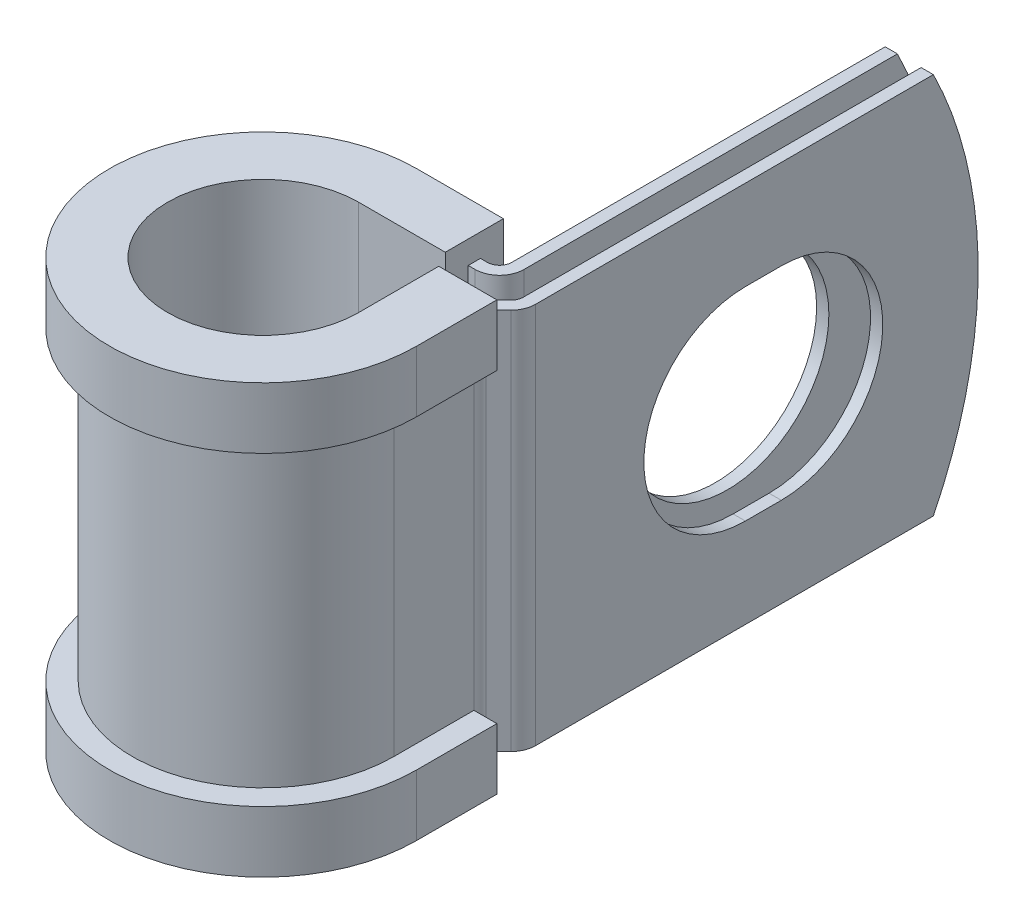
ISO-10303-21;
HEADER;
FILE_DESCRIPTION(('STEP AP214'),'2;1');
FILE_NAME('part.step','',(''),(''),'','','');
FILE_SCHEMA(('AUTOMOTIVE_DESIGN { 1 0 10303 214 1 1 1 1 }'));
ENDSEC;
DATA;
#1=APPLICATION_CONTEXT('core data for automotive mechanical design processes');
#2=APPLICATION_PROTOCOL_DEFINITION('international standard','automotive_design',2000,#1);
#3=PRODUCT_CONTEXT('',#1,'mechanical');
#4=PRODUCT('Part','Part','',(#3));
#5=PRODUCT_RELATED_PRODUCT_CATEGORY('part','',(#4));
#6=PRODUCT_DEFINITION_FORMATION('','',#4);
#7=PRODUCT_DEFINITION_CONTEXT('part definition',#1,'design');
#8=PRODUCT_DEFINITION('design','',#6,#7);
#9=PRODUCT_DEFINITION_SHAPE('','',#8);
#10=(LENGTH_UNIT() NAMED_UNIT(*) SI_UNIT(.MILLI.,.METRE.));
#11=(NAMED_UNIT(*) PLANE_ANGLE_UNIT() SI_UNIT($,.RADIAN.));
#12=(NAMED_UNIT(*) SI_UNIT($,.STERADIAN.) SOLID_ANGLE_UNIT());
#13=UNCERTAINTY_MEASURE_WITH_UNIT(LENGTH_MEASURE(1.E-05),#10,'distance_accuracy_value','');
#14=(GEOMETRIC_REPRESENTATION_CONTEXT(3) GLOBAL_UNCERTAINTY_ASSIGNED_CONTEXT((#13)) GLOBAL_UNIT_ASSIGNED_CONTEXT((#10,
#11,#12)) REPRESENTATION_CONTEXT('',''));
#15=CARTESIAN_POINT('',(0.,0.,0.));
#16=DIRECTION('',(0.,0.,1.));
#17=DIRECTION('',(1.,0.,0.));
#18=AXIS2_PLACEMENT_3D('',#15,#16,#17);
#19=CARTESIAN_POINT('',(8.60157438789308,-12.7,-7.874));
#20=DIRECTION('',(0.,1.,0.));
#21=DIRECTION('',(1.,0.,0.));
#22=AXIS2_PLACEMENT_3D('',#19,#20,#21);
#23=PLANE('',#22);
#24=DIRECTION('',(0.,0.,-1.));
#25=VECTOR('',#24,1.);
#26=CARTESIAN_POINT('',(5.75677438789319,-12.7,-7.87399999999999));
#27=LINE('',#26,#25);
#28=CARTESIAN_POINT('',(5.75677438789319,-12.7,-7.87399999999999));
#29=VERTEX_POINT('',#28);
#30=CARTESIAN_POINT('',(5.7567743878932,-12.7,-8.6868));
#31=VERTEX_POINT('',#30);
#32=EDGE_CURVE('E523',#29,#31,#27,.T.);
#33=ORIENTED_EDGE('',*,*,#32,.T.);
#34=DIRECTION('',(1.,0.,0.));
#35=VECTOR('',#34,1.);
#36=CARTESIAN_POINT('',(0.,-12.7,-8.6868));
#37=LINE('',#36,#35);
#38=CARTESIAN_POINT('',(6.21397438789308,-12.7,-8.6868));
#39=VERTEX_POINT('',#38);
#40=EDGE_CURVE('E410',#39,#31,#37,.F.);
#41=ORIENTED_EDGE('',*,*,#40,.F.);
#42=CARTESIAN_POINT('',(6.21397438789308,-12.7,-9.4996));
#43=DIRECTION('',(0.,1.,0.));
#44=DIRECTION('',(1.,0.,0.));
#45=AXIS2_PLACEMENT_3D('',#42,#43,#44);
#46=CIRCLE('',#45,0.812799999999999);
#47=CARTESIAN_POINT('',(7.02677438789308,-12.7,-9.4996));
#48=VERTEX_POINT('',#47);
#49=EDGE_CURVE('E408',#48,#39,#46,.F.);
#50=ORIENTED_EDGE('',*,*,#49,.F.);
#51=DIRECTION('',(0.,0.,1.));
#52=VECTOR('',#51,1.);
#53=CARTESIAN_POINT('',(7.02677438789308,-12.7,-37.2872));
#54=LINE('',#53,#52);
#55=CARTESIAN_POINT('',(7.02677438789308,-12.7,-34.3098683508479));
#56=VERTEX_POINT('',#55);
#57=EDGE_CURVE('E406',#56,#48,#54,.T.);
#58=ORIENTED_EDGE('',*,*,#57,.F.);
#59=DIRECTION('',(-1.,0.,0.));
#60=VECTOR('',#59,1.);
#61=CARTESIAN_POINT('',(10.2271743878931,-12.7,-34.3098683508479));
#62=LINE('',#61,#60);
#63=CARTESIAN_POINT('',(7.83957438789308,-12.7,-34.3098683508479));
#64=VERTEX_POINT('',#63);
#65=EDGE_CURVE('E12',#64,#56,#62,.T.);
#66=ORIENTED_EDGE('',*,*,#65,.F.);
#67=DIRECTION('',(0.,0.,1.));
#68=VECTOR('',#67,1.);
#69=CARTESIAN_POINT('',(7.83957438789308,-12.7,-37.2872));
#70=LINE('',#69,#68);
#71=CARTESIAN_POINT('',(7.83957438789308,-12.7,-9.4996));
#72=VERTEX_POINT('',#71);
#73=EDGE_CURVE('E404',#64,#72,#70,.T.);
#74=ORIENTED_EDGE('',*,*,#73,.T.);
#75=CARTESIAN_POINT('',(6.21397438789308,-12.7,-9.4996));
#76=DIRECTION('',(0.,-1.,0.));
#77=DIRECTION('',(0.,0.,1.));
#78=AXIS2_PLACEMENT_3D('',#75,#76,#77);
#79=CIRCLE('',#78,1.6256);
#80=CARTESIAN_POINT('',(6.21397438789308,-12.7,-7.874));
#81=VERTEX_POINT('',#80);
#82=EDGE_CURVE('E401',#72,#81,#79,.T.);
#83=ORIENTED_EDGE('',*,*,#82,.T.);
#84=DIRECTION('',(-1.,0.,0.));
#85=VECTOR('',#84,1.);
#86=CARTESIAN_POINT('',(0.,-12.7,-7.874));
#87=LINE('',#86,#85);
#88=EDGE_CURVE('E398',#81,#29,#87,.T.);
#89=ORIENTED_EDGE('',*,*,#88,.T.);
#90=EDGE_LOOP('',(#33,#41,#50,#58,#66,#74,#83,#89));
#91=FACE_BOUND('',#90,.T.);
#92=ADVANCED_FACE('F54',(#91),#23,.F.);
#93=CARTESIAN_POINT('',(8.60157438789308,12.7,-7.874));
#94=DIRECTION('',(0.,1.,0.));
#95=DIRECTION('',(1.,0.,0.));
#96=AXIS2_PLACEMENT_3D('',#93,#94,#95);
#97=PLANE('',#96);
#98=DIRECTION('',(1.,0.,0.));
#99=VECTOR('',#98,1.);
#100=CARTESIAN_POINT('',(0.,12.7,-8.6868));
#101=LINE('',#100,#99);
#102=CARTESIAN_POINT('',(6.21397438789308,12.7,-8.6868));
#103=VERTEX_POINT('',#102);
#104=CARTESIAN_POINT('',(5.7567743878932,12.7,-8.6868));
#105=VERTEX_POINT('',#104);
#106=EDGE_CURVE('E368',#103,#105,#101,.F.);
#107=ORIENTED_EDGE('',*,*,#106,.T.);
#108=DIRECTION('',(0.,0.,1.));
#109=VECTOR('',#108,1.);
#110=CARTESIAN_POINT('',(5.7567743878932,12.7,-8.6868));
#111=LINE('',#110,#109);
#112=CARTESIAN_POINT('',(5.75677438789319,12.7,-7.874));
#113=VERTEX_POINT('',#112);
#114=EDGE_CURVE('E517',#105,#113,#111,.T.);
#115=ORIENTED_EDGE('',*,*,#114,.T.);
#116=DIRECTION('',(-1.,0.,0.));
#117=VECTOR('',#116,1.);
#118=CARTESIAN_POINT('',(0.,12.7,-7.874));
#119=LINE('',#118,#117);
#120=CARTESIAN_POINT('',(6.21397438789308,12.7,-7.874));
#121=VERTEX_POINT('',#120);
#122=EDGE_CURVE('E625',#121,#113,#119,.T.);
#123=ORIENTED_EDGE('',*,*,#122,.F.);
#124=CARTESIAN_POINT('',(6.21397438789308,12.7,-9.4996));
#125=DIRECTION('',(0.,-1.,0.));
#126=DIRECTION('',(0.,0.,1.));
#127=AXIS2_PLACEMENT_3D('',#124,#125,#126);
#128=CIRCLE('',#127,1.6256);
#129=CARTESIAN_POINT('',(7.83957438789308,12.7,-9.4996));
#130=VERTEX_POINT('',#129);
#131=EDGE_CURVE('E370',#130,#121,#128,.T.);
#132=ORIENTED_EDGE('',*,*,#131,.F.);
#133=DIRECTION('',(0.,0.,1.));
#134=VECTOR('',#133,1.);
#135=CARTESIAN_POINT('',(7.83957438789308,12.7,-37.2872));
#136=LINE('',#135,#134);
#137=CARTESIAN_POINT('',(7.83957438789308,12.7,-34.3098683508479));
#138=VERTEX_POINT('',#137);
#139=EDGE_CURVE('E361',#138,#130,#136,.T.);
#140=ORIENTED_EDGE('',*,*,#139,.F.);
#141=DIRECTION('',(-1.,0.,0.));
#142=VECTOR('',#141,1.);
#143=CARTESIAN_POINT('',(10.2271743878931,12.7,-34.3098683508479));
#144=LINE('',#143,#142);
#145=CARTESIAN_POINT('',(7.02677438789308,12.7,-34.3098683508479));
#146=VERTEX_POINT('',#145);
#147=EDGE_CURVE('E62',#138,#146,#144,.T.);
#148=ORIENTED_EDGE('',*,*,#147,.T.);
#149=DIRECTION('',(0.,0.,1.));
#150=VECTOR('',#149,1.);
#151=CARTESIAN_POINT('',(7.02677438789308,12.7,-37.2872));
#152=LINE('',#151,#150);
#153=CARTESIAN_POINT('',(7.02677438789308,12.7,-9.4996));
#154=VERTEX_POINT('',#153);
#155=EDGE_CURVE('E358',#146,#154,#152,.T.);
#156=ORIENTED_EDGE('',*,*,#155,.T.);
#157=CARTESIAN_POINT('',(6.21397438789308,12.7,-9.4996));
#158=DIRECTION('',(0.,1.,0.));
#159=DIRECTION('',(1.,0.,0.));
#160=AXIS2_PLACEMENT_3D('',#157,#158,#159);
#161=CIRCLE('',#160,0.812799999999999);
#162=EDGE_CURVE('E366',#154,#103,#161,.F.);
#163=ORIENTED_EDGE('',*,*,#162,.T.);
#164=EDGE_LOOP('',(#107,#115,#123,#132,#140,#148,#156,#163));
#165=FACE_BOUND('',#164,.T.);
#166=ADVANCED_FACE('F357',(#165),#97,.T.);
#167=CARTESIAN_POINT('',(0.,12.7,-7.874));
#168=DIRECTION('',(0.,0.,1.));
#169=DIRECTION('',(1.,0.,0.));
#170=AXIS2_PLACEMENT_3D('',#167,#168,#169);
#171=PLANE('',#170);
#172=ORIENTED_EDGE('',*,*,#122,.T.);
#173=DIRECTION('',(0.,-1.,0.));
#174=VECTOR('',#173,1.);
#175=CARTESIAN_POINT('',(5.75677438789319,12.7,-7.874));
#176=LINE('',#175,#174);
#177=EDGE_CURVE('E520',#113,#29,#176,.T.);
#178=ORIENTED_EDGE('',*,*,#177,.T.);
#179=ORIENTED_EDGE('',*,*,#88,.F.);
#180=DIRECTION('',(0.,-1.,0.));
#181=VECTOR('',#180,1.);
#182=CARTESIAN_POINT('',(6.21397438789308,12.7,-7.874));
#183=LINE('',#182,#181);
#184=EDGE_CURVE('E344',#121,#81,#183,.T.);
#185=ORIENTED_EDGE('',*,*,#184,.F.);
#186=EDGE_LOOP('',(#172,#178,#179,#185));
#187=FACE_BOUND('',#186,.T.);
#188=ADVANCED_FACE('F635',(#187),#171,.T.);
#189=CARTESIAN_POINT('',(10.2271743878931,12.7,-7.874));
#190=DIRECTION('',(-1.,0.,0.));
#191=DIRECTION('',(0.,0.,1.));
#192=AXIS2_PLACEMENT_3D('',#189,#190,#191);
#193=PLANE('',#192);
#194=CARTESIAN_POINT('',(10.2271743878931,0.,-24.2061999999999));
#195=DIRECTION('',(1.,0.,0.));
#196=DIRECTION('',(0.,0.,-1.));
#197=AXIS2_PLACEMENT_3D('',#194,#195,#196);
#198=CIRCLE('',#197,6.7437);
#199=CARTESIAN_POINT('',(10.2271743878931,-6.7437,-24.2062000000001));
#200=VERTEX_POINT('',#199);
#201=CARTESIAN_POINT('',(10.2271743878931,6.7437,-24.2062000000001));
#202=VERTEX_POINT('',#201);
#203=EDGE_CURVE('E580',#200,#202,#198,.T.);
#204=ORIENTED_EDGE('',*,*,#203,.F.);
#205=DIRECTION('',(0.,0.,-1.));
#206=VECTOR('',#205,1.);
#207=CARTESIAN_POINT('',(10.2271743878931,-6.7437,-21.8185999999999));
#208=LINE('',#207,#206);
#209=CARTESIAN_POINT('',(10.2271743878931,-6.7437,-21.8185999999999));
#210=VERTEX_POINT('',#209);
#211=EDGE_CURVE('E583',#210,#200,#208,.T.);
#212=ORIENTED_EDGE('',*,*,#211,.F.);
#213=CARTESIAN_POINT('',(10.2271743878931,0.,-21.8185999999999));
#214=DIRECTION('',(1.,0.,0.));
#215=DIRECTION('',(0.,0.,-1.));
#216=AXIS2_PLACEMENT_3D('',#213,#214,#215);
#217=CIRCLE('',#216,6.7437);
#218=CARTESIAN_POINT('',(10.2271743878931,6.7437,-21.8185999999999));
#219=VERTEX_POINT('',#218);
#220=EDGE_CURVE('E576',#219,#210,#217,.T.);
#221=ORIENTED_EDGE('',*,*,#220,.F.);
#222=DIRECTION('',(0.,0.,1.));
#223=VECTOR('',#222,1.);
#224=CARTESIAN_POINT('',(10.2271743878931,6.7437,-21.8185999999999));
#225=LINE('',#224,#223);
#226=EDGE_CURVE('E577',#202,#219,#225,.T.);
#227=ORIENTED_EDGE('',*,*,#226,.F.);
#228=EDGE_LOOP('',(#204,#212,#221,#227));
#229=FACE_BOUND('',#228,.T.);
#230=DIRECTION('',(0.,0.,-1.));
#231=VECTOR('',#230,1.);
#232=CARTESIAN_POINT('',(10.2271743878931,-12.7,-7.874));
#233=LINE('',#232,#231);
#234=CARTESIAN_POINT('',(10.2271743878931,-12.7,-7.874));
#235=VERTEX_POINT('',#234);
#236=CARTESIAN_POINT('',(10.2271743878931,-12.7,-34.3098683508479));
#237=VERTEX_POINT('',#236);
#238=EDGE_CURVE('E382',#235,#237,#233,.T.);
#239=ORIENTED_EDGE('',*,*,#238,.T.);
#240=CARTESIAN_POINT('',(10.2271743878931,0.,-8.7122));
#241=DIRECTION('',(-1.,0.,0.));
#242=DIRECTION('',(0.,0.,1.));
#243=AXIS2_PLACEMENT_3D('',#240,#241,#242);
#244=CIRCLE('',#243,28.575);
#245=CARTESIAN_POINT('',(10.2271743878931,12.7,-34.3098683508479));
#246=VERTEX_POINT('',#245);
#247=EDGE_CURVE('E568',#246,#237,#244,.T.);
#248=ORIENTED_EDGE('',*,*,#247,.F.);
#249=DIRECTION('',(0.,0.,-1.));
#250=VECTOR('',#249,1.);
#251=CARTESIAN_POINT('',(10.2271743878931,12.7,-7.874));
#252=LINE('',#251,#250);
#253=CARTESIAN_POINT('',(10.2271743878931,12.7,-7.874));
#254=VERTEX_POINT('',#253);
#255=EDGE_CURVE('E419',#254,#246,#252,.T.);
#256=ORIENTED_EDGE('',*,*,#255,.F.);
#257=DIRECTION('',(0.,-1.,0.));
#258=VECTOR('',#257,1.);
#259=CARTESIAN_POINT('',(10.2271743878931,12.7,-7.874));
#260=LINE('',#259,#258);
#261=EDGE_CURVE('E381',#254,#235,#260,.T.);
#262=ORIENTED_EDGE('',*,*,#261,.T.);
#263=EDGE_LOOP('',(#239,#248,#256,#262));
#264=FACE_BOUND('',#263,.T.);
#265=ADVANCED_FACE('F56',(#229,#264),#193,.F.);
#266=CARTESIAN_POINT('',(9.41437438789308,12.7,-7.874));
#267=DIRECTION('',(-1.,0.,0.));
#268=DIRECTION('',(0.,0.,1.));
#269=AXIS2_PLACEMENT_3D('',#266,#267,#268);
#270=PLANE('',#269);
#271=DIRECTION('',(0.,0.,-1.));
#272=VECTOR('',#271,1.);
#273=CARTESIAN_POINT('',(9.41437438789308,-6.7437,-21.8185999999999));
#274=LINE('',#273,#272);
#275=CARTESIAN_POINT('',(9.41437438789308,-6.7437,-21.8185999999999));
#276=VERTEX_POINT('',#275);
#277=CARTESIAN_POINT('',(9.41437438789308,-6.7437,-24.2062000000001));
#278=VERTEX_POINT('',#277);
#279=EDGE_CURVE('E579',#276,#278,#274,.T.);
#280=ORIENTED_EDGE('',*,*,#279,.T.);
#281=CARTESIAN_POINT('',(9.41437438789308,0.,-24.2061999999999));
#282=DIRECTION('',(-1.,0.,0.));
#283=DIRECTION('',(0.,0.,1.));
#284=AXIS2_PLACEMENT_3D('',#281,#282,#283);
#285=CIRCLE('',#284,6.7437);
#286=CARTESIAN_POINT('',(9.41437438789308,6.7437,-24.2062000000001));
#287=VERTEX_POINT('',#286);
#288=EDGE_CURVE('E600',#278,#287,#285,.F.);
#289=ORIENTED_EDGE('',*,*,#288,.T.);
#290=DIRECTION('',(0.,0.,1.));
#291=VECTOR('',#290,1.);
#292=CARTESIAN_POINT('',(9.41437438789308,6.7437,-21.8185999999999));
#293=LINE('',#292,#291);
#294=CARTESIAN_POINT('',(9.41437438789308,6.7437,-21.8185999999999));
#295=VERTEX_POINT('',#294);
#296=EDGE_CURVE('E596',#287,#295,#293,.T.);
#297=ORIENTED_EDGE('',*,*,#296,.T.);
#298=CARTESIAN_POINT('',(9.41437438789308,0.,-21.8185999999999));
#299=DIRECTION('',(-1.,0.,0.));
#300=DIRECTION('',(0.,0.,1.));
#301=AXIS2_PLACEMENT_3D('',#298,#299,#300);
#302=CIRCLE('',#301,6.7437);
#303=EDGE_CURVE('E591',#295,#276,#302,.F.);
#304=ORIENTED_EDGE('',*,*,#303,.T.);
#305=EDGE_LOOP('',(#280,#289,#297,#304));
#306=FACE_BOUND('',#305,.T.);
#307=CARTESIAN_POINT('',(9.41437438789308,0.,-8.7122));
#308=DIRECTION('',(-1.,0.,0.));
#309=DIRECTION('',(0.,0.,1.));
#310=AXIS2_PLACEMENT_3D('',#307,#308,#309);
#311=CIRCLE('',#310,28.575);
#312=CARTESIAN_POINT('',(9.41437438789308,12.7,-34.3098683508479));
#313=VERTEX_POINT('',#312);
#314=CARTESIAN_POINT('',(9.41437438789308,-12.7,-34.3098683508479));
#315=VERTEX_POINT('',#314);
#316=EDGE_CURVE('E76',#313,#315,#311,.T.);
#317=ORIENTED_EDGE('',*,*,#316,.T.);
#318=DIRECTION('',(0.,0.,-1.));
#319=VECTOR('',#318,1.);
#320=CARTESIAN_POINT('',(9.41437438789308,-12.7,-7.874));
#321=LINE('',#320,#319);
#322=CARTESIAN_POINT('',(9.41437438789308,-12.7,-7.874));
#323=VERTEX_POINT('',#322);
#324=EDGE_CURVE('E385',#323,#315,#321,.T.);
#325=ORIENTED_EDGE('',*,*,#324,.F.);
#326=DIRECTION('',(0.,-1.,0.));
#327=VECTOR('',#326,1.);
#328=CARTESIAN_POINT('',(9.41437438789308,12.7,-7.874));
#329=LINE('',#328,#327);
#330=CARTESIAN_POINT('',(9.41437438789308,12.7,-7.874));
#331=VERTEX_POINT('',#330);
#332=EDGE_CURVE('E352',#331,#323,#329,.T.);
#333=ORIENTED_EDGE('',*,*,#332,.F.);
#334=DIRECTION('',(0.,0.,-1.));
#335=VECTOR('',#334,1.);
#336=CARTESIAN_POINT('',(9.41437438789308,12.7,-7.874));
#337=LINE('',#336,#335);
#338=EDGE_CURVE('E615',#331,#313,#337,.T.);
#339=ORIENTED_EDGE('',*,*,#338,.T.);
#340=EDGE_LOOP('',(#317,#325,#333,#339));
#341=FACE_BOUND('',#340,.T.);
#342=ADVANCED_FACE('F689',(#306,#341),#270,.T.);
#343=CARTESIAN_POINT('',(7.83957438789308,12.7,-37.2872));
#344=DIRECTION('',(1.,0.,0.));
#345=DIRECTION('',(0.,0.,-1.));
#346=AXIS2_PLACEMENT_3D('',#343,#344,#345);
#347=PLANE('',#346);
#348=CARTESIAN_POINT('',(7.83957438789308,0.,-23.0124));
#349=DIRECTION('',(1.,0.,0.));
#350=DIRECTION('',(0.,0.,-1.));
#351=AXIS2_PLACEMENT_3D('',#348,#349,#350);
#352=CIRCLE('',#351,6.7437);
#353=CARTESIAN_POINT('',(7.83957438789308,0.,-29.7561));
#354=VERTEX_POINT('',#353);
#355=EDGE_CURVE('E386',#354,#354,#352,.F.);
#356=ORIENTED_EDGE('',*,*,#355,.T.);
#357=EDGE_LOOP('',(#356));
#358=FACE_BOUND('',#357,.T.);
#359=ORIENTED_EDGE('',*,*,#73,.F.);
#360=CARTESIAN_POINT('',(7.83957438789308,0.,-8.7122));
#361=DIRECTION('',(1.,0.,0.));
#362=DIRECTION('',(0.,0.,-1.));
#363=AXIS2_PLACEMENT_3D('',#360,#361,#362);
#364=CIRCLE('',#363,28.575);
#365=EDGE_CURVE('E573',#64,#138,#364,.T.);
#366=ORIENTED_EDGE('',*,*,#365,.T.);
#367=ORIENTED_EDGE('',*,*,#139,.T.);
#368=DIRECTION('',(0.,-1.,0.));
#369=VECTOR('',#368,1.);
#370=CARTESIAN_POINT('',(7.83957438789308,12.7,-9.4996));
#371=LINE('',#370,#369);
#372=EDGE_CURVE('E341',#130,#72,#371,.T.);
#373=ORIENTED_EDGE('',*,*,#372,.T.);
#374=EDGE_LOOP('',(#359,#366,#367,#373));
#375=FACE_BOUND('',#374,.T.);
#376=ADVANCED_FACE('F641',(#358,#375),#347,.T.);
#377=CARTESIAN_POINT('',(7.02677438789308,12.7,-37.2872));
#378=DIRECTION('',(1.,0.,0.));
#379=DIRECTION('',(0.,0.,-1.));
#380=AXIS2_PLACEMENT_3D('',#377,#378,#379);
#381=PLANE('',#380);
#382=CARTESIAN_POINT('',(7.02677438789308,0.,-23.0124));
#383=DIRECTION('',(-1.,0.,0.));
#384=DIRECTION('',(0.,0.,1.));
#385=AXIS2_PLACEMENT_3D('',#382,#383,#384);
#386=CIRCLE('',#385,6.7437);
#387=CARTESIAN_POINT('',(7.02677438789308,0.,-16.2687));
#388=VERTEX_POINT('',#387);
#389=EDGE_CURVE('E608',#388,#388,#386,.T.);
#390=ORIENTED_EDGE('',*,*,#389,.F.);
#391=EDGE_LOOP('',(#390));
#392=FACE_BOUND('',#391,.T.);
#393=CARTESIAN_POINT('',(7.02677438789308,0.,-8.7122));
#394=DIRECTION('',(-1.,0.,0.));
#395=DIRECTION('',(0.,0.,1.));
#396=AXIS2_PLACEMENT_3D('',#393,#394,#395);
#397=CIRCLE('',#396,28.575);
#398=EDGE_CURVE('E68',#146,#56,#397,.T.);
#399=ORIENTED_EDGE('',*,*,#398,.T.);
#400=ORIENTED_EDGE('',*,*,#57,.T.);
#401=DIRECTION('',(0.,-1.,0.));
#402=VECTOR('',#401,1.);
#403=CARTESIAN_POINT('',(7.02677438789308,12.7,-9.4996));
#404=LINE('',#403,#402);
#405=EDGE_CURVE('E338',#154,#48,#404,.T.);
#406=ORIENTED_EDGE('',*,*,#405,.F.);
#407=ORIENTED_EDGE('',*,*,#155,.F.);
#408=EDGE_LOOP('',(#399,#400,#406,#407));
#409=FACE_BOUND('',#408,.T.);
#410=ADVANCED_FACE('F364',(#392,#409),#381,.F.);
#411=CARTESIAN_POINT('',(9.4996,-12.7,-5.32360726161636));
#412=DIRECTION('',(0.,1.,0.));
#413=DIRECTION('',(1.,0.,0.));
#414=AXIS2_PLACEMENT_3D('',#411,#412,#413);
#415=CIRCLE('',#414,0.8128);
#416=CARTESIAN_POINT('',(8.6868,-12.7,-5.32360726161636));
#417=VERTEX_POINT('',#416);
#418=CARTESIAN_POINT('',(8.92486360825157,-12.7,-5.89834365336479));
#419=VERTEX_POINT('',#418);
#420=EDGE_CURVE('E413',#417,#419,#415,.F.);
#421=ORIENTED_EDGE('',*,*,#420,.F.);
#422=DIRECTION('',(1.,0.,0.));
#423=VECTOR('',#422,1.);
#424=CARTESIAN_POINT('',(7.87399999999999,-12.7,-5.32360726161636));
#425=LINE('',#424,#423);
#426=CARTESIAN_POINT('',(7.87399999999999,-12.7,-5.32360726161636));
#427=VERTEX_POINT('',#426);
#428=EDGE_CURVE('E451',#427,#417,#425,.T.);
#429=ORIENTED_EDGE('',*,*,#428,.F.);
#430=CARTESIAN_POINT('',(9.4996,-12.7,-5.32360726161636));
#431=DIRECTION('',(0.,-1.,0.));
#432=DIRECTION('',(0.,0.,1.));
#433=AXIS2_PLACEMENT_3D('',#430,#431,#432);
#434=CIRCLE('',#433,1.6256);
#435=CARTESIAN_POINT('',(8.35012721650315,-12.7,-6.47308004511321));
#436=VERTEX_POINT('',#435);
#437=EDGE_CURVE('E395',#427,#436,#434,.T.);
#438=ORIENTED_EDGE('',*,*,#437,.T.);
#439=DIRECTION('',(0.707106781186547,0.,-0.707106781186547));
#440=VECTOR('',#439,1.);
#441=CARTESIAN_POINT('',(8.35012721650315,-12.7,-6.47308004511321));
#442=LINE('',#441,#440);
#443=CARTESIAN_POINT('',(9.17631077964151,-12.7,-7.29926360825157));
#444=VERTEX_POINT('',#443);
#445=EDGE_CURVE('E392',#436,#444,#442,.T.);
#446=ORIENTED_EDGE('',*,*,#445,.T.);
#447=CARTESIAN_POINT('',(8.60157438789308,-12.7,-7.874));
#448=DIRECTION('',(0.,1.,0.));
#449=DIRECTION('',(0.,0.,1.));
#450=AXIS2_PLACEMENT_3D('',#447,#448,#449);
#451=CIRCLE('',#450,0.812800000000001);
#452=EDGE_CURVE('E389',#444,#323,#451,.T.);
#453=ORIENTED_EDGE('',*,*,#452,.T.);
#454=ORIENTED_EDGE('',*,*,#324,.T.);
#455=DIRECTION('',(-1.,0.,0.));
#456=VECTOR('',#455,1.);
#457=CARTESIAN_POINT('',(10.2271743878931,-12.7,-34.3098683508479));
#458=LINE('',#457,#456);
#459=EDGE_CURVE('E566',#237,#315,#458,.T.);
#460=ORIENTED_EDGE('',*,*,#459,.F.);
#461=ORIENTED_EDGE('',*,*,#238,.F.);
#462=CARTESIAN_POINT('',(8.60157438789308,-12.7,-7.874));
#463=DIRECTION('',(0.,1.,0.));
#464=DIRECTION('',(1.,0.,0.));
#465=AXIS2_PLACEMENT_3D('',#462,#463,#464);
#466=CIRCLE('',#465,1.6256);
#467=CARTESIAN_POINT('',(9.75104717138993,-12.7,-6.72452721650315));
#468=VERTEX_POINT('',#467);
#469=EDGE_CURVE('E417',#468,#235,#466,.T.);
#470=ORIENTED_EDGE('',*,*,#469,.F.);
#471=DIRECTION('',(0.707106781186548,0.,-0.707106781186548));
#472=VECTOR('',#471,1.);
#473=CARTESIAN_POINT('',(8.92486360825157,-12.7,-5.89834365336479));
#474=LINE('',#473,#472);
#475=EDGE_CURVE('E415',#419,#468,#474,.T.);
#476=ORIENTED_EDGE('',*,*,#475,.F.);
#477=EDGE_LOOP('',(#421,#429,#438,#446,#453,#454,#460,#461,#470,#476));
#478=FACE_BOUND('',#477,.T.);
#479=ADVANCED_FACE('F675',(#478),#23,.F.);
#480=DIRECTION('',(-1.,0.,0.));
#481=VECTOR('',#480,1.);
#482=CARTESIAN_POINT('',(8.6868,12.7,-5.32360726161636));
#483=LINE('',#482,#481);
#484=CARTESIAN_POINT('',(8.6868,12.7,-5.32360726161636));
#485=VERTEX_POINT('',#484);
#486=CARTESIAN_POINT('',(7.874,12.7,-5.32360726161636));
#487=VERTEX_POINT('',#486);
#488=EDGE_CURVE('E440',#485,#487,#483,.T.);
#489=ORIENTED_EDGE('',*,*,#488,.F.);
#490=CARTESIAN_POINT('',(9.4996,12.7,-5.32360726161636));
#491=DIRECTION('',(0.,1.,0.));
#492=DIRECTION('',(1.,0.,0.));
#493=AXIS2_PLACEMENT_3D('',#490,#491,#492);
#494=CIRCLE('',#493,0.8128);
#495=CARTESIAN_POINT('',(8.92486360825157,12.7,-5.89834365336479));
#496=VERTEX_POINT('',#495);
#497=EDGE_CURVE('E375',#485,#496,#494,.F.);
#498=ORIENTED_EDGE('',*,*,#497,.T.);
#499=DIRECTION('',(0.707106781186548,0.,-0.707106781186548));
#500=VECTOR('',#499,1.);
#501=CARTESIAN_POINT('',(8.92486360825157,12.7,-5.89834365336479));
#502=LINE('',#501,#500);
#503=CARTESIAN_POINT('',(9.75104717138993,12.7,-6.72452721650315));
#504=VERTEX_POINT('',#503);
#505=EDGE_CURVE('E377',#496,#504,#502,.T.);
#506=ORIENTED_EDGE('',*,*,#505,.T.);
#507=CARTESIAN_POINT('',(8.60157438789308,12.7,-7.874));
#508=DIRECTION('',(0.,1.,0.));
#509=DIRECTION('',(1.,0.,0.));
#510=AXIS2_PLACEMENT_3D('',#507,#508,#509);
#511=CIRCLE('',#510,1.6256);
#512=EDGE_CURVE('E379',#504,#254,#511,.T.);
#513=ORIENTED_EDGE('',*,*,#512,.T.);
#514=ORIENTED_EDGE('',*,*,#255,.T.);
#515=DIRECTION('',(-1.,0.,0.));
#516=VECTOR('',#515,1.);
#517=CARTESIAN_POINT('',(10.2271743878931,12.7,-34.3098683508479));
#518=LINE('',#517,#516);
#519=EDGE_CURVE('E570',#246,#313,#518,.T.);
#520=ORIENTED_EDGE('',*,*,#519,.T.);
#521=ORIENTED_EDGE('',*,*,#338,.F.);
#522=CARTESIAN_POINT('',(8.60157438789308,12.7,-7.874));
#523=DIRECTION('',(0.,1.,0.));
#524=DIRECTION('',(0.,0.,1.));
#525=AXIS2_PLACEMENT_3D('',#522,#523,#524);
#526=CIRCLE('',#525,0.812800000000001);
#527=CARTESIAN_POINT('',(9.17631077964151,12.7,-7.29926360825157));
#528=VERTEX_POINT('',#527);
#529=EDGE_CURVE('E618',#528,#331,#526,.T.);
#530=ORIENTED_EDGE('',*,*,#529,.F.);
#531=DIRECTION('',(0.707106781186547,0.,-0.707106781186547));
#532=VECTOR('',#531,1.);
#533=CARTESIAN_POINT('',(8.35012721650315,12.7,-6.47308004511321));
#534=LINE('',#533,#532);
#535=CARTESIAN_POINT('',(8.35012721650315,12.7,-6.47308004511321));
#536=VERTEX_POINT('',#535);
#537=EDGE_CURVE('E621',#536,#528,#534,.T.);
#538=ORIENTED_EDGE('',*,*,#537,.F.);
#539=CARTESIAN_POINT('',(9.4996,12.7,-5.32360726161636));
#540=DIRECTION('',(0.,-1.,0.));
#541=DIRECTION('',(0.,0.,1.));
#542=AXIS2_PLACEMENT_3D('',#539,#540,#541);
#543=CIRCLE('',#542,1.6256);
#544=EDGE_CURVE('E450',#487,#536,#543,.T.);
#545=ORIENTED_EDGE('',*,*,#544,.F.);
#546=EDGE_LOOP('',(#489,#498,#506,#513,#514,#520,#521,#530,#538,#545));
#547=FACE_BOUND('',#546,.T.);
#548=ADVANCED_FACE('F447',(#547),#97,.T.);
#549=CARTESIAN_POINT('',(8.60157438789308,12.7,-7.874));
#550=DIRECTION('',(0.,-1.,0.));
#551=DIRECTION('',(0.,0.,-1.));
#552=AXIS2_PLACEMENT_3D('',#549,#550,#551);
#553=CYLINDRICAL_SURFACE('',#552,0.812800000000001);
#554=ORIENTED_EDGE('',*,*,#452,.F.);
#555=DIRECTION('',(0.,-1.,0.));
#556=VECTOR('',#555,1.);
#557=CARTESIAN_POINT('',(9.17631077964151,12.7,-7.29926360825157));
#558=LINE('',#557,#556);
#559=EDGE_CURVE('E350',#528,#444,#558,.T.);
#560=ORIENTED_EDGE('',*,*,#559,.F.);
#561=ORIENTED_EDGE('',*,*,#529,.T.);
#562=ORIENTED_EDGE('',*,*,#332,.T.);
#563=EDGE_LOOP('',(#554,#560,#561,#562));
#564=FACE_BOUND('',#563,.T.);
#565=ADVANCED_FACE('F685',(#564),#553,.F.);
#566=CARTESIAN_POINT('',(8.35012721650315,12.7,-6.47308004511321));
#567=DIRECTION('',(-0.707106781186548,0.,-0.707106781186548));
#568=DIRECTION('',(-0.707106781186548,0.,0.707106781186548));
#569=AXIS2_PLACEMENT_3D('',#566,#567,#568);
#570=PLANE('',#569);
#571=ORIENTED_EDGE('',*,*,#445,.F.);
#572=DIRECTION('',(0.,-1.,0.));
#573=VECTOR('',#572,1.);
#574=CARTESIAN_POINT('',(8.35012721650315,12.7,-6.47308004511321));
#575=LINE('',#574,#573);
#576=EDGE_CURVE('E348',#536,#436,#575,.T.);
#577=ORIENTED_EDGE('',*,*,#576,.F.);
#578=ORIENTED_EDGE('',*,*,#537,.T.);
#579=ORIENTED_EDGE('',*,*,#559,.T.);
#580=EDGE_LOOP('',(#571,#577,#578,#579));
#581=FACE_BOUND('',#580,.T.);
#582=ADVANCED_FACE('F680',(#581),#570,.T.);
#583=CARTESIAN_POINT('',(9.4996,12.7,-5.32360726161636));
#584=DIRECTION('',(0.,-1.,0.));
#585=DIRECTION('',(0.,0.,-1.));
#586=AXIS2_PLACEMENT_3D('',#583,#584,#585);
#587=CYLINDRICAL_SURFACE('',#586,1.6256);
#588=ORIENTED_EDGE('',*,*,#437,.F.);
#589=DIRECTION('',(0.,-1.,0.));
#590=VECTOR('',#589,1.);
#591=CARTESIAN_POINT('',(7.874,12.7,-5.32360726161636));
#592=LINE('',#591,#590);
#593=EDGE_CURVE('E346',#487,#427,#592,.T.);
#594=ORIENTED_EDGE('',*,*,#593,.F.);
#595=ORIENTED_EDGE('',*,*,#544,.T.);
#596=ORIENTED_EDGE('',*,*,#576,.T.);
#597=EDGE_LOOP('',(#588,#594,#595,#596));
#598=FACE_BOUND('',#597,.T.);
#599=ADVANCED_FACE('F677',(#598),#587,.T.);
#600=CARTESIAN_POINT('',(6.21397438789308,12.7,-9.4996));
#601=DIRECTION('',(0.,-1.,0.));
#602=DIRECTION('',(0.,0.,-1.));
#603=AXIS2_PLACEMENT_3D('',#600,#601,#602);
#604=CYLINDRICAL_SURFACE('',#603,1.6256);
#605=ORIENTED_EDGE('',*,*,#82,.F.);
#606=ORIENTED_EDGE('',*,*,#372,.F.);
#607=ORIENTED_EDGE('',*,*,#131,.T.);
#608=ORIENTED_EDGE('',*,*,#184,.T.);
#609=EDGE_LOOP('',(#605,#606,#607,#608));
#610=FACE_BOUND('',#609,.T.);
#611=ADVANCED_FACE('F631',(#610),#604,.T.);
#612=CARTESIAN_POINT('',(6.21397438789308,12.7,-9.4996));
#613=DIRECTION('',(0.,-1.,0.));
#614=DIRECTION('',(0.,0.,-1.));
#615=AXIS2_PLACEMENT_3D('',#612,#613,#614);
#616=CYLINDRICAL_SURFACE('',#615,0.812799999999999);
#617=ORIENTED_EDGE('',*,*,#49,.T.);
#618=DIRECTION('',(0.,-1.,0.));
#619=VECTOR('',#618,1.);
#620=CARTESIAN_POINT('',(6.21397438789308,12.7,-8.6868));
#621=LINE('',#620,#619);
#622=EDGE_CURVE('E329',#103,#39,#621,.T.);
#623=ORIENTED_EDGE('',*,*,#622,.F.);
#624=ORIENTED_EDGE('',*,*,#162,.F.);
#625=ORIENTED_EDGE('',*,*,#405,.T.);
#626=EDGE_LOOP('',(#617,#623,#624,#625));
#627=FACE_BOUND('',#626,.T.);
#628=ADVANCED_FACE('F646',(#627),#616,.F.);
#629=CARTESIAN_POINT('',(0.,12.7,-8.6868));
#630=DIRECTION('',(0.,0.,1.));
#631=DIRECTION('',(1.,0.,0.));
#632=AXIS2_PLACEMENT_3D('',#629,#630,#631);
#633=PLANE('',#632);
#634=DIRECTION('',(0.,-1.,0.));
#635=VECTOR('',#634,1.);
#636=CARTESIAN_POINT('',(0.,12.7,-8.6868));
#637=LINE('',#636,#635);
#638=CARTESIAN_POINT('',(1.21851113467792E-13,10.16,-8.6868));
#639=VERTEX_POINT('',#638);
#640=CARTESIAN_POINT('',(1.21851113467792E-13,-10.16,-8.6868));
#641=VERTEX_POINT('',#640);
#642=EDGE_CURVE('E320',#639,#641,#637,.T.);
#643=ORIENTED_EDGE('',*,*,#642,.F.);
#644=DIRECTION('',(1.,0.,0.));
#645=VECTOR('',#644,1.);
#646=CARTESIAN_POINT('',(1.21851113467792E-13,10.16,-8.6868));
#647=LINE('',#646,#645);
#648=CARTESIAN_POINT('',(5.7567743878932,10.16,-8.6868));
#649=VERTEX_POINT('',#648);
#650=EDGE_CURVE('E563',#639,#649,#647,.T.);
#651=ORIENTED_EDGE('',*,*,#650,.T.);
#652=DIRECTION('',(0.,1.,0.));
#653=VECTOR('',#652,1.);
#654=CARTESIAN_POINT('',(5.7567743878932,12.7,-8.6868));
#655=LINE('',#654,#653);
#656=EDGE_CURVE('E514',#649,#105,#655,.T.);
#657=ORIENTED_EDGE('',*,*,#656,.T.);
#658=ORIENTED_EDGE('',*,*,#106,.F.);
#659=ORIENTED_EDGE('',*,*,#622,.T.);
#660=ORIENTED_EDGE('',*,*,#40,.T.);
#661=DIRECTION('',(0.,1.,0.));
#662=VECTOR('',#661,1.);
#663=CARTESIAN_POINT('',(5.7567743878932,-12.7,-8.6868));
#664=LINE('',#663,#662);
#665=CARTESIAN_POINT('',(5.7567743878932,-10.16,-8.6868));
#666=VERTEX_POINT('',#665);
#667=EDGE_CURVE('E526',#31,#666,#664,.T.);
#668=ORIENTED_EDGE('',*,*,#667,.T.);
#669=DIRECTION('',(1.,0.,0.));
#670=VECTOR('',#669,1.);
#671=CARTESIAN_POINT('',(1.21851113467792E-13,-10.16,-8.6868));
#672=LINE('',#671,#670);
#673=EDGE_CURVE('E543',#641,#666,#672,.T.);
#674=ORIENTED_EDGE('',*,*,#673,.F.);
#675=EDGE_LOOP('',(#643,#651,#657,#658,#659,#660,#668,#674));
#676=FACE_BOUND('',#675,.T.);
#677=ADVANCED_FACE('F650',(#676),#633,.F.);
#678=CARTESIAN_POINT('',(0.,12.7,0.));
#679=DIRECTION('',(0.,-1.,0.));
#680=DIRECTION('',(0.,0.,-1.));
#681=AXIS2_PLACEMENT_3D('',#678,#679,#680);
#682=CYLINDRICAL_SURFACE('',#681,8.6868);
#683=DIRECTION('',(0.,-1.,0.));
#684=VECTOR('',#683,1.);
#685=CARTESIAN_POINT('',(8.6868,12.7,0.));
#686=LINE('',#685,#684);
#687=CARTESIAN_POINT('',(8.6868,10.16,0.));
#688=VERTEX_POINT('',#687);
#689=CARTESIAN_POINT('',(8.6868,-10.16,0.));
#690=VERTEX_POINT('',#689);
#691=EDGE_CURVE('E318',#688,#690,#686,.T.);
#692=ORIENTED_EDGE('',*,*,#691,.F.);
#693=CARTESIAN_POINT('',(0.,10.16,0.));
#694=DIRECTION('',(0.,-1.,0.));
#695=DIRECTION('',(0.,0.,-1.));
#696=AXIS2_PLACEMENT_3D('',#693,#694,#695);
#697=CIRCLE('',#696,8.6868);
#698=EDGE_CURVE('E512',#688,#639,#697,.T.);
#699=ORIENTED_EDGE('',*,*,#698,.T.);
#700=ORIENTED_EDGE('',*,*,#642,.T.);
#701=CARTESIAN_POINT('',(0.,-10.16,0.));
#702=DIRECTION('',(0.,-1.,0.));
#703=DIRECTION('',(0.,0.,-1.));
#704=AXIS2_PLACEMENT_3D('',#701,#702,#703);
#705=CIRCLE('',#704,8.6868);
#706=EDGE_CURVE('E301',#690,#641,#705,.T.);
#707=ORIENTED_EDGE('',*,*,#706,.F.);
#708=EDGE_LOOP('',(#692,#699,#700,#707));
#709=FACE_BOUND('',#708,.T.);
#710=ADVANCED_FACE('F316',(#709),#682,.T.);
#711=CARTESIAN_POINT('',(8.6868,12.7,0.));
#712=DIRECTION('',(-1.,0.,0.));
#713=DIRECTION('',(0.,0.,1.));
#714=AXIS2_PLACEMENT_3D('',#711,#712,#713);
#715=PLANE('',#714);
#716=DIRECTION('',(0.,-1.,0.));
#717=VECTOR('',#716,1.);
#718=CARTESIAN_POINT('',(8.6868,12.7,-5.32360726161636));
#719=LINE('',#718,#717);
#720=CARTESIAN_POINT('',(8.6868,10.16,-5.32360726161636));
#721=VERTEX_POINT('',#720);
#722=CARTESIAN_POINT('',(8.6868,-10.16,-5.32360726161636));
#723=VERTEX_POINT('',#722);
#724=EDGE_CURVE('E332',#721,#723,#719,.T.);
#725=ORIENTED_EDGE('',*,*,#724,.F.);
#726=DIRECTION('',(0.,0.,-1.));
#727=VECTOR('',#726,1.);
#728=CARTESIAN_POINT('',(8.6868,10.16,0.));
#729=LINE('',#728,#727);
#730=EDGE_CURVE('E326',#688,#721,#729,.T.);
#731=ORIENTED_EDGE('',*,*,#730,.F.);
#732=ORIENTED_EDGE('',*,*,#691,.T.);
#733=DIRECTION('',(0.,0.,-1.));
#734=VECTOR('',#733,1.);
#735=CARTESIAN_POINT('',(8.6868,-10.16,0.));
#736=LINE('',#735,#734);
#737=EDGE_CURVE('E297',#690,#723,#736,.T.);
#738=ORIENTED_EDGE('',*,*,#737,.T.);
#739=EDGE_LOOP('',(#725,#731,#732,#738));
#740=FACE_BOUND('',#739,.T.);
#741=ADVANCED_FACE('F325',(#740),#715,.F.);
#742=CARTESIAN_POINT('',(9.4996,12.7,-5.32360726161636));
#743=DIRECTION('',(0.,-1.,0.));
#744=DIRECTION('',(0.,0.,-1.));
#745=AXIS2_PLACEMENT_3D('',#742,#743,#744);
#746=CYLINDRICAL_SURFACE('',#745,0.8128);
#747=ORIENTED_EDGE('',*,*,#420,.T.);
#748=DIRECTION('',(0.,-1.,0.));
#749=VECTOR('',#748,1.);
#750=CARTESIAN_POINT('',(8.92486360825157,12.7,-5.89834365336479));
#751=LINE('',#750,#749);
#752=EDGE_CURVE('E424',#496,#419,#751,.T.);
#753=ORIENTED_EDGE('',*,*,#752,.F.);
#754=ORIENTED_EDGE('',*,*,#497,.F.);
#755=EDGE_CURVE('E327',#485,#721,#719,.T.);
#756=ORIENTED_EDGE('',*,*,#755,.T.);
#757=ORIENTED_EDGE('',*,*,#724,.T.);
#758=DIRECTION('',(0.,1.,0.));
#759=VECTOR('',#758,1.);
#760=CARTESIAN_POINT('',(8.6868,-12.7,-5.32360726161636));
#761=LINE('',#760,#759);
#762=EDGE_CURVE('E433',#417,#723,#761,.T.);
#763=ORIENTED_EDGE('',*,*,#762,.F.);
#764=EDGE_LOOP('',(#747,#753,#754,#756,#757,#763));
#765=FACE_BOUND('',#764,.T.);
#766=ADVANCED_FACE('F432',(#765),#746,.F.);
#767=CARTESIAN_POINT('',(8.92486360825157,12.7,-5.89834365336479));
#768=DIRECTION('',(-0.707106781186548,0.,-0.707106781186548));
#769=DIRECTION('',(-0.707106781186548,0.,0.707106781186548));
#770=AXIS2_PLACEMENT_3D('',#767,#768,#769);
#771=PLANE('',#770);
#772=ORIENTED_EDGE('',*,*,#475,.T.);
#773=DIRECTION('',(0.,-1.,0.));
#774=VECTOR('',#773,1.);
#775=CARTESIAN_POINT('',(9.75104717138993,12.7,-6.72452721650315));
#776=LINE('',#775,#774);
#777=EDGE_CURVE('E422',#504,#468,#776,.T.);
#778=ORIENTED_EDGE('',*,*,#777,.F.);
#779=ORIENTED_EDGE('',*,*,#505,.F.);
#780=ORIENTED_EDGE('',*,*,#752,.T.);
#781=EDGE_LOOP('',(#772,#778,#779,#780));
#782=FACE_BOUND('',#781,.T.);
#783=ADVANCED_FACE('F701',(#782),#771,.F.);
#784=CARTESIAN_POINT('',(8.60157438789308,12.7,-7.874));
#785=DIRECTION('',(0.,-1.,0.));
#786=DIRECTION('',(0.,0.,-1.));
#787=AXIS2_PLACEMENT_3D('',#784,#785,#786);
#788=CYLINDRICAL_SURFACE('',#787,1.6256);
#789=ORIENTED_EDGE('',*,*,#469,.T.);
#790=ORIENTED_EDGE('',*,*,#261,.F.);
#791=ORIENTED_EDGE('',*,*,#512,.F.);
#792=ORIENTED_EDGE('',*,*,#777,.T.);
#793=EDGE_LOOP('',(#789,#790,#791,#792));
#794=FACE_BOUND('',#793,.T.);
#795=ADVANCED_FACE('F699',(#794),#788,.T.);
#796=CARTESIAN_POINT('',(26.913638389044,0.,-23.0124));
#797=DIRECTION('',(-1.,0.,0.));
#798=DIRECTION('',(0.,0.,1.));
#799=AXIS2_PLACEMENT_3D('',#796,#797,#798);
#800=CYLINDRICAL_SURFACE('',#799,6.7437);
#801=ORIENTED_EDGE('',*,*,#389,.T.);
#802=EDGE_LOOP('',(#801));
#803=FACE_BOUND('',#802,.T.);
#804=ORIENTED_EDGE('',*,*,#355,.F.);
#805=EDGE_LOOP('',(#804));
#806=FACE_BOUND('',#805,.T.);
#807=ADVANCED_FACE('F708',(#803,#806),#800,.F.);
#808=CARTESIAN_POINT('',(-11.416506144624,-6.7437,-21.8185999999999));
#809=DIRECTION('',(0.,-1.,0.));
#810=DIRECTION('',(0.,0.,-1.));
#811=AXIS2_PLACEMENT_3D('',#808,#809,#810);
#812=PLANE('',#811);
#813=DIRECTION('',(1.,0.,0.));
#814=VECTOR('',#813,1.);
#815=CARTESIAN_POINT('',(-11.416506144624,-6.7437,-21.8185999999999));
#816=LINE('',#815,#814);
#817=EDGE_CURVE('E594',#276,#210,#816,.T.);
#818=ORIENTED_EDGE('',*,*,#817,.T.);
#819=ORIENTED_EDGE('',*,*,#211,.T.);
#820=DIRECTION('',(1.,0.,0.));
#821=VECTOR('',#820,1.);
#822=CARTESIAN_POINT('',(-11.416506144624,-6.7437,-24.2062000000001));
#823=LINE('',#822,#821);
#824=EDGE_CURVE('E590',#278,#200,#823,.T.);
#825=ORIENTED_EDGE('',*,*,#824,.F.);
#826=ORIENTED_EDGE('',*,*,#279,.F.);
#827=EDGE_LOOP('',(#818,#819,#825,#826));
#828=FACE_BOUND('',#827,.T.);
#829=ADVANCED_FACE('F751',(#828),#812,.F.);
#830=CARTESIAN_POINT('',(-11.416506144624,0.,-24.2061999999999));
#831=DIRECTION('',(1.,0.,0.));
#832=DIRECTION('',(0.,0.,-1.));
#833=AXIS2_PLACEMENT_3D('',#830,#831,#832);
#834=CYLINDRICAL_SURFACE('',#833,6.7437);
#835=ORIENTED_EDGE('',*,*,#824,.T.);
#836=ORIENTED_EDGE('',*,*,#203,.T.);
#837=DIRECTION('',(1.,0.,0.));
#838=VECTOR('',#837,1.);
#839=CARTESIAN_POINT('',(-11.416506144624,6.7437,-24.2062000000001));
#840=LINE('',#839,#838);
#841=EDGE_CURVE('E599',#287,#202,#840,.T.);
#842=ORIENTED_EDGE('',*,*,#841,.F.);
#843=ORIENTED_EDGE('',*,*,#288,.F.);
#844=EDGE_LOOP('',(#835,#836,#842,#843));
#845=FACE_BOUND('',#844,.T.);
#846=ADVANCED_FACE('F755',(#845),#834,.F.);
#847=CARTESIAN_POINT('',(-11.416506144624,6.7437,-21.8185999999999));
#848=DIRECTION('',(0.,1.,0.));
#849=DIRECTION('',(0.,0.,1.));
#850=AXIS2_PLACEMENT_3D('',#847,#848,#849);
#851=PLANE('',#850);
#852=ORIENTED_EDGE('',*,*,#841,.T.);
#853=ORIENTED_EDGE('',*,*,#226,.T.);
#854=DIRECTION('',(1.,0.,0.));
#855=VECTOR('',#854,1.);
#856=CARTESIAN_POINT('',(-11.416506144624,6.7437,-21.8185999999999));
#857=LINE('',#856,#855);
#858=EDGE_CURVE('E595',#295,#219,#857,.T.);
#859=ORIENTED_EDGE('',*,*,#858,.F.);
#860=ORIENTED_EDGE('',*,*,#296,.F.);
#861=EDGE_LOOP('',(#852,#853,#859,#860));
#862=FACE_BOUND('',#861,.T.);
#863=ADVANCED_FACE('F759',(#862),#851,.F.);
#864=CARTESIAN_POINT('',(-11.416506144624,0.,-21.8185999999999));
#865=DIRECTION('',(1.,0.,0.));
#866=DIRECTION('',(0.,0.,-1.));
#867=AXIS2_PLACEMENT_3D('',#864,#865,#866);
#868=CYLINDRICAL_SURFACE('',#867,6.7437);
#869=ORIENTED_EDGE('',*,*,#858,.T.);
#870=ORIENTED_EDGE('',*,*,#220,.T.);
#871=ORIENTED_EDGE('',*,*,#817,.F.);
#872=ORIENTED_EDGE('',*,*,#303,.F.);
#873=EDGE_LOOP('',(#869,#870,#871,#872));
#874=FACE_BOUND('',#873,.T.);
#875=ADVANCED_FACE('F763',(#874),#868,.F.);
#876=CARTESIAN_POINT('',(10.2271743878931,0.,-8.7122));
#877=DIRECTION('',(-1.,0.,0.));
#878=DIRECTION('',(0.,0.,1.));
#879=AXIS2_PLACEMENT_3D('',#876,#877,#878);
#880=CYLINDRICAL_SURFACE('',#879,28.575);
#881=ORIENTED_EDGE('',*,*,#365,.F.);
#882=ORIENTED_EDGE('',*,*,#65,.T.);
#883=ORIENTED_EDGE('',*,*,#398,.F.);
#884=ORIENTED_EDGE('',*,*,#147,.F.);
#885=EDGE_LOOP('',(#881,#882,#883,#884));
#886=FACE_BOUND('',#885,.T.);
#887=ADVANCED_FACE('F642',(#886),#880,.T.);
#888=ORIENTED_EDGE('',*,*,#519,.F.);
#889=ORIENTED_EDGE('',*,*,#247,.T.);
#890=ORIENTED_EDGE('',*,*,#459,.T.);
#891=ORIENTED_EDGE('',*,*,#316,.F.);
#892=EDGE_LOOP('',(#888,#889,#890,#891));
#893=FACE_BOUND('',#892,.T.);
#894=ADVANCED_FACE('F690',(#893),#880,.T.);
#895=CARTESIAN_POINT('',(1.43228501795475E-13,14.224,-10.2108));
#896=DIRECTION('',(0.,0.,1.));
#897=DIRECTION('',(1.,0.,0.));
#898=AXIS2_PLACEMENT_3D('',#895,#896,#897);
#899=PLANE('',#898);
#900=DIRECTION('',(0.,-1.,0.));
#901=VECTOR('',#900,1.);
#902=CARTESIAN_POINT('',(1.43228501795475E-13,14.224,-10.2108));
#903=LINE('',#902,#901);
#904=CARTESIAN_POINT('',(1.43228501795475E-13,14.224,-10.2108));
#905=VERTEX_POINT('',#904);
#906=CARTESIAN_POINT('',(1.43228501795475E-13,10.16,-10.2108));
#907=VERTEX_POINT('',#906);
#908=EDGE_CURVE('E322',#905,#907,#903,.T.);
#909=ORIENTED_EDGE('',*,*,#908,.F.);
#910=DIRECTION('',(1.,0.,0.));
#911=VECTOR('',#910,1.);
#912=CARTESIAN_POINT('',(1.43228501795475E-13,14.224,-10.2108));
#913=LINE('',#912,#911);
#914=CARTESIAN_POINT('',(5.75677438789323,14.224,-10.2108));
#915=VERTEX_POINT('',#914);
#916=EDGE_CURVE('E557',#905,#915,#913,.T.);
#917=ORIENTED_EDGE('',*,*,#916,.T.);
#918=DIRECTION('',(0.,-1.,0.));
#919=VECTOR('',#918,1.);
#920=CARTESIAN_POINT('',(5.75677438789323,14.224,-10.2108));
#921=LINE('',#920,#919);
#922=CARTESIAN_POINT('',(5.75677438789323,10.16,-10.2108));
#923=VERTEX_POINT('',#922);
#924=EDGE_CURVE('E539',#915,#923,#921,.T.);
#925=ORIENTED_EDGE('',*,*,#924,.T.);
#926=DIRECTION('',(1.,0.,0.));
#927=VECTOR('',#926,1.);
#928=CARTESIAN_POINT('',(1.43228501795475E-13,10.16,-10.2108));
#929=LINE('',#928,#927);
#930=EDGE_CURVE('E560',#907,#923,#929,.T.);
#931=ORIENTED_EDGE('',*,*,#930,.F.);
#932=EDGE_LOOP('',(#909,#917,#925,#931));
#933=FACE_BOUND('',#932,.T.);
#934=ADVANCED_FACE('F854',(#933),#899,.F.);
#935=CARTESIAN_POINT('',(0.,14.224,-6.35));
#936=DIRECTION('',(0.,0.,-1.));
#937=DIRECTION('',(0.,1.,0.));
#938=AXIS2_PLACEMENT_3D('',#935,#936,#937);
#939=PLANE('',#938);
#940=DIRECTION('',(0.,1.,0.));
#941=VECTOR('',#940,1.);
#942=CARTESIAN_POINT('',(0.,14.224,-6.35));
#943=LINE('',#942,#941);
#944=CARTESIAN_POINT('',(0.,-14.224,-6.34999999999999));
#945=VERTEX_POINT('',#944);
#946=CARTESIAN_POINT('',(0.,14.224,-6.35));
#947=VERTEX_POINT('',#946);
#948=EDGE_CURVE('E490',#945,#947,#943,.T.);
#949=ORIENTED_EDGE('',*,*,#948,.F.);
#950=DIRECTION('',(1.,0.,0.));
#951=VECTOR('',#950,1.);
#952=CARTESIAN_POINT('',(0.,-14.224,-6.34999999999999));
#953=LINE('',#952,#951);
#954=CARTESIAN_POINT('',(5.75677438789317,-14.224,-6.34999999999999));
#955=VERTEX_POINT('',#954);
#956=EDGE_CURVE('E551',#945,#955,#953,.T.);
#957=ORIENTED_EDGE('',*,*,#956,.T.);
#958=DIRECTION('',(0.,1.,0.));
#959=VECTOR('',#958,1.);
#960=CARTESIAN_POINT('',(5.75677438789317,14.224,-6.35));
#961=LINE('',#960,#959);
#962=CARTESIAN_POINT('',(5.75677438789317,14.224,-6.35));
#963=VERTEX_POINT('',#962);
#964=EDGE_CURVE('E535',#955,#963,#961,.T.);
#965=ORIENTED_EDGE('',*,*,#964,.T.);
#966=DIRECTION('',(1.,0.,0.));
#967=VECTOR('',#966,1.);
#968=CARTESIAN_POINT('',(0.,14.224,-6.35));
#969=LINE('',#968,#967);
#970=EDGE_CURVE('E554',#947,#963,#969,.T.);
#971=ORIENTED_EDGE('',*,*,#970,.F.);
#972=EDGE_LOOP('',(#949,#957,#965,#971));
#973=FACE_BOUND('',#972,.T.);
#974=ADVANCED_FACE('F940',(#973),#939,.F.);
#975=CARTESIAN_POINT('',(1.43228501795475E-13,-14.224,-10.2108));
#976=DIRECTION('',(0.,0.,1.));
#977=DIRECTION('',(1.,0.,0.));
#978=AXIS2_PLACEMENT_3D('',#975,#976,#977);
#979=PLANE('',#978);
#980=DIRECTION('',(0.,-1.,0.));
#981=VECTOR('',#980,1.);
#982=CARTESIAN_POINT('',(1.43228501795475E-13,-14.224,-10.2108));
#983=LINE('',#982,#981);
#984=CARTESIAN_POINT('',(1.43228501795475E-13,-10.16,-10.2108));
#985=VERTEX_POINT('',#984);
#986=CARTESIAN_POINT('',(1.43228501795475E-13,-14.224,-10.2108));
#987=VERTEX_POINT('',#986);
#988=EDGE_CURVE('E476',#985,#987,#983,.T.);
#989=ORIENTED_EDGE('',*,*,#988,.F.);
#990=DIRECTION('',(1.,0.,0.));
#991=VECTOR('',#990,1.);
#992=CARTESIAN_POINT('',(1.43228501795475E-13,-10.16,-10.2108));
#993=LINE('',#992,#991);
#994=CARTESIAN_POINT('',(5.75677438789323,-10.16,-10.2108));
#995=VERTEX_POINT('',#994);
#996=EDGE_CURVE('E545',#985,#995,#993,.T.);
#997=ORIENTED_EDGE('',*,*,#996,.T.);
#998=DIRECTION('',(0.,-1.,0.));
#999=VECTOR('',#998,1.);
#1000=CARTESIAN_POINT('',(5.75677438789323,-14.224,-10.2108));
#1001=LINE('',#1000,#999);
#1002=CARTESIAN_POINT('',(5.75677438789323,-14.224,-10.2108));
#1003=VERTEX_POINT('',#1002);
#1004=EDGE_CURVE('E531',#995,#1003,#1001,.T.);
#1005=ORIENTED_EDGE('',*,*,#1004,.T.);
#1006=DIRECTION('',(1.,0.,0.));
#1007=VECTOR('',#1006,1.);
#1008=CARTESIAN_POINT('',(1.43228501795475E-13,-14.224,-10.2108));
#1009=LINE('',#1008,#1007);
#1010=EDGE_CURVE('E548',#987,#1003,#1009,.T.);
#1011=ORIENTED_EDGE('',*,*,#1010,.F.);
#1012=EDGE_LOOP('',(#989,#997,#1005,#1011));
#1013=FACE_BOUND('',#1012,.T.);
#1014=ADVANCED_FACE('F661',(#1013),#979,.F.);
#1015=CARTESIAN_POINT('',(0.,12.7,0.));
#1016=DIRECTION('',(0.,-1.,0.));
#1017=DIRECTION('',(0.,0.,-1.));
#1018=AXIS2_PLACEMENT_3D('',#1015,#1016,#1017);
#1019=CYLINDRICAL_SURFACE('',#1018,10.2108);
#1020=DIRECTION('',(0.,-1.,0.));
#1021=VECTOR('',#1020,1.);
#1022=CARTESIAN_POINT('',(10.2108,14.224,0.));
#1023=LINE('',#1022,#1021);
#1024=CARTESIAN_POINT('',(10.2108,14.224,0.));
#1025=VERTEX_POINT('',#1024);
#1026=CARTESIAN_POINT('',(10.2108,10.16,0.));
#1027=VERTEX_POINT('',#1026);
#1028=EDGE_CURVE('E311',#1025,#1027,#1023,.T.);
#1029=ORIENTED_EDGE('',*,*,#1028,.F.);
#1030=CARTESIAN_POINT('',(0.,14.224,0.));
#1031=DIRECTION('',(0.,-1.,0.));
#1032=DIRECTION('',(0.,0.,-1.));
#1033=AXIS2_PLACEMENT_3D('',#1030,#1031,#1032);
#1034=CIRCLE('',#1033,10.2108);
#1035=EDGE_CURVE('E506',#1025,#905,#1034,.T.);
#1036=ORIENTED_EDGE('',*,*,#1035,.T.);
#1037=ORIENTED_EDGE('',*,*,#908,.T.);
#1038=CARTESIAN_POINT('',(0.,10.16,0.));
#1039=DIRECTION('',(0.,-1.,0.));
#1040=DIRECTION('',(0.,0.,-1.));
#1041=AXIS2_PLACEMENT_3D('',#1038,#1039,#1040);
#1042=CIRCLE('',#1041,10.2108);
#1043=EDGE_CURVE('E509',#1027,#907,#1042,.T.);
#1044=ORIENTED_EDGE('',*,*,#1043,.F.);
#1045=EDGE_LOOP('',(#1029,#1036,#1037,#1044));
#1046=FACE_BOUND('',#1045,.T.);
#1047=ADVANCED_FACE('F960',(#1046),#1019,.T.);
#1048=CARTESIAN_POINT('',(0.,12.7,0.));
#1049=DIRECTION('',(0.,-1.,0.));
#1050=DIRECTION('',(0.,0.,-1.));
#1051=AXIS2_PLACEMENT_3D('',#1048,#1049,#1050);
#1052=CYLINDRICAL_SURFACE('',#1051,6.35);
#1053=DIRECTION('',(0.,1.,0.));
#1054=VECTOR('',#1053,1.);
#1055=CARTESIAN_POINT('',(6.35,14.224,0.));
#1056=LINE('',#1055,#1054);
#1057=CARTESIAN_POINT('',(6.34999999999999,-14.224,0.));
#1058=VERTEX_POINT('',#1057);
#1059=CARTESIAN_POINT('',(6.35,14.224,0.));
#1060=VERTEX_POINT('',#1059);
#1061=EDGE_CURVE('E1123',#1058,#1060,#1056,.T.);
#1062=ORIENTED_EDGE('',*,*,#1061,.F.);
#1063=CARTESIAN_POINT('',(0.,-14.224,0.));
#1064=DIRECTION('',(0.,-1.,0.));
#1065=DIRECTION('',(0.,0.,-1.));
#1066=AXIS2_PLACEMENT_3D('',#1063,#1064,#1065);
#1067=CIRCLE('',#1066,6.34999999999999);
#1068=EDGE_CURVE('E500',#1058,#945,#1067,.T.);
#1069=ORIENTED_EDGE('',*,*,#1068,.T.);
#1070=ORIENTED_EDGE('',*,*,#948,.T.);
#1071=CARTESIAN_POINT('',(0.,14.224,0.));
#1072=DIRECTION('',(0.,-1.,0.));
#1073=DIRECTION('',(0.,0.,-1.));
#1074=AXIS2_PLACEMENT_3D('',#1071,#1072,#1073);
#1075=CIRCLE('',#1074,6.35);
#1076=EDGE_CURVE('E503',#1060,#947,#1075,.T.);
#1077=ORIENTED_EDGE('',*,*,#1076,.F.);
#1078=EDGE_LOOP('',(#1062,#1069,#1070,#1077));
#1079=FACE_BOUND('',#1078,.T.);
#1080=ADVANCED_FACE('F970',(#1079),#1052,.F.);
#1081=CARTESIAN_POINT('',(0.,12.7,0.));
#1082=DIRECTION('',(0.,-1.,0.));
#1083=DIRECTION('',(0.,0.,-1.));
#1084=AXIS2_PLACEMENT_3D('',#1081,#1082,#1083);
#1085=CYLINDRICAL_SURFACE('',#1084,10.2108);
#1086=DIRECTION('',(0.,-1.,0.));
#1087=VECTOR('',#1086,1.);
#1088=CARTESIAN_POINT('',(10.2108,-14.224,0.));
#1089=LINE('',#1088,#1087);
#1090=CARTESIAN_POINT('',(10.2108,-10.16,0.));
#1091=VERTEX_POINT('',#1090);
#1092=CARTESIAN_POINT('',(10.2108,-14.224,0.));
#1093=VERTEX_POINT('',#1092);
#1094=EDGE_CURVE('E474',#1091,#1093,#1089,.T.);
#1095=ORIENTED_EDGE('',*,*,#1094,.F.);
#1096=CARTESIAN_POINT('',(0.,-10.16,0.));
#1097=DIRECTION('',(0.,-1.,0.));
#1098=DIRECTION('',(0.,0.,-1.));
#1099=AXIS2_PLACEMENT_3D('',#1096,#1097,#1098);
#1100=CIRCLE('',#1099,10.2108);
#1101=EDGE_CURVE('E321',#1091,#985,#1100,.T.);
#1102=ORIENTED_EDGE('',*,*,#1101,.T.);
#1103=ORIENTED_EDGE('',*,*,#988,.T.);
#1104=CARTESIAN_POINT('',(0.,-14.224,0.));
#1105=DIRECTION('',(0.,-1.,0.));
#1106=DIRECTION('',(0.,0.,-1.));
#1107=AXIS2_PLACEMENT_3D('',#1104,#1105,#1106);
#1108=CIRCLE('',#1107,10.2108);
#1109=EDGE_CURVE('E497',#1093,#987,#1108,.T.);
#1110=ORIENTED_EDGE('',*,*,#1109,.F.);
#1111=EDGE_LOOP('',(#1095,#1102,#1103,#1110));
#1112=FACE_BOUND('',#1111,.T.);
#1113=ADVANCED_FACE('F664',(#1112),#1085,.T.);
#1114=CARTESIAN_POINT('',(10.2108,10.16,0.));
#1115=DIRECTION('',(0.,-1.,0.));
#1116=DIRECTION('',(0.,0.,-1.));
#1117=AXIS2_PLACEMENT_3D('',#1114,#1115,#1116);
#1118=PLANE('',#1117);
#1119=DIRECTION('',(-1.,0.,0.));
#1120=VECTOR('',#1119,1.);
#1121=CARTESIAN_POINT('',(10.2108,10.16,-5.32360726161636));
#1122=LINE('',#1121,#1120);
#1123=CARTESIAN_POINT('',(10.2108,10.16,-5.32360726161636));
#1124=VERTEX_POINT('',#1123);
#1125=EDGE_CURVE('E444',#1124,#721,#1122,.T.);
#1126=ORIENTED_EDGE('',*,*,#1125,.F.);
#1127=DIRECTION('',(0.,0.,-1.));
#1128=VECTOR('',#1127,1.);
#1129=CARTESIAN_POINT('',(10.2108,10.16,0.));
#1130=LINE('',#1129,#1128);
#1131=EDGE_CURVE('E477',#1027,#1124,#1130,.T.);
#1132=ORIENTED_EDGE('',*,*,#1131,.F.);
#1133=ORIENTED_EDGE('',*,*,#1043,.T.);
#1134=ORIENTED_EDGE('',*,*,#930,.T.);
#1135=DIRECTION('',(0.,0.,1.));
#1136=VECTOR('',#1135,1.);
#1137=CARTESIAN_POINT('',(5.75677438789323,10.16,-10.2108));
#1138=LINE('',#1137,#1136);
#1139=EDGE_CURVE('E541',#923,#649,#1138,.T.);
#1140=ORIENTED_EDGE('',*,*,#1139,.T.);
#1141=ORIENTED_EDGE('',*,*,#650,.F.);
#1142=ORIENTED_EDGE('',*,*,#698,.F.);
#1143=ORIENTED_EDGE('',*,*,#730,.T.);
#1144=EDGE_LOOP('',(#1126,#1132,#1133,#1134,#1140,#1141,#1142,#1143));
#1145=FACE_BOUND('',#1144,.T.);
#1146=ADVANCED_FACE('F991',(#1145),#1118,.T.);
#1147=CARTESIAN_POINT('',(10.2108,14.224,0.));
#1148=DIRECTION('',(1.,0.,0.));
#1149=DIRECTION('',(0.,0.,-1.));
#1150=AXIS2_PLACEMENT_3D('',#1147,#1148,#1149);
#1151=PLANE('',#1150);
#1152=DIRECTION('',(0.,-1.,0.));
#1153=VECTOR('',#1152,1.);
#1154=CARTESIAN_POINT('',(10.2108,14.224,-5.32360726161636));
#1155=LINE('',#1154,#1153);
#1156=CARTESIAN_POINT('',(10.2108,14.224,-5.32360726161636));
#1157=VERTEX_POINT('',#1156);
#1158=EDGE_CURVE('E471',#1157,#1124,#1155,.T.);
#1159=ORIENTED_EDGE('',*,*,#1158,.F.);
#1160=DIRECTION('',(0.,0.,-1.));
#1161=VECTOR('',#1160,1.);
#1162=CARTESIAN_POINT('',(10.2108,14.224,0.));
#1163=LINE('',#1162,#1161);
#1164=EDGE_CURVE('E479',#1025,#1157,#1163,.T.);
#1165=ORIENTED_EDGE('',*,*,#1164,.F.);
#1166=ORIENTED_EDGE('',*,*,#1028,.T.);
#1167=ORIENTED_EDGE('',*,*,#1131,.T.);
#1168=EDGE_LOOP('',(#1159,#1165,#1166,#1167));
#1169=FACE_BOUND('',#1168,.T.);
#1170=ADVANCED_FACE('F1002',(#1169),#1151,.T.);
#1171=CARTESIAN_POINT('',(10.2108,14.224,0.));
#1172=DIRECTION('',(0.,1.,0.));
#1173=DIRECTION('',(0.,0.,1.));
#1174=AXIS2_PLACEMENT_3D('',#1171,#1172,#1173);
#1175=PLANE('',#1174);
#1176=DIRECTION('',(1.,0.,0.));
#1177=VECTOR('',#1176,1.);
#1178=CARTESIAN_POINT('',(10.2108,14.224,-5.32360726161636));
#1179=LINE('',#1178,#1177);
#1180=CARTESIAN_POINT('',(6.35,14.224,-5.32360726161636));
#1181=VERTEX_POINT('',#1180);
#1182=EDGE_CURVE('E468',#1181,#1157,#1179,.T.);
#1183=ORIENTED_EDGE('',*,*,#1182,.F.);
#1184=DIRECTION('',(0.,0.,-1.));
#1185=VECTOR('',#1184,1.);
#1186=CARTESIAN_POINT('',(6.35,14.224,0.));
#1187=LINE('',#1186,#1185);
#1188=EDGE_CURVE('E481',#1060,#1181,#1187,.T.);
#1189=ORIENTED_EDGE('',*,*,#1188,.F.);
#1190=ORIENTED_EDGE('',*,*,#1076,.T.);
#1191=ORIENTED_EDGE('',*,*,#970,.T.);
#1192=DIRECTION('',(0.,0.,-1.));
#1193=VECTOR('',#1192,1.);
#1194=CARTESIAN_POINT('',(5.75677438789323,14.224,-10.2108));
#1195=LINE('',#1194,#1193);
#1196=EDGE_CURVE('E537',#963,#915,#1195,.T.);
#1197=ORIENTED_EDGE('',*,*,#1196,.T.);
#1198=ORIENTED_EDGE('',*,*,#916,.F.);
#1199=ORIENTED_EDGE('',*,*,#1035,.F.);
#1200=ORIENTED_EDGE('',*,*,#1164,.T.);
#1201=EDGE_LOOP('',(#1183,#1189,#1190,#1191,#1197,#1198,#1199,#1200));
#1202=FACE_BOUND('',#1201,.T.);
#1203=ADVANCED_FACE('F1014',(#1202),#1175,.T.);
#1204=CARTESIAN_POINT('',(6.35,14.224,0.));
#1205=DIRECTION('',(-1.,0.,0.));
#1206=DIRECTION('',(0.,-1.,0.));
#1207=AXIS2_PLACEMENT_3D('',#1204,#1205,#1206);
#1208=PLANE('',#1207);
#1209=DIRECTION('',(0.,1.,0.));
#1210=VECTOR('',#1209,1.);
#1211=CARTESIAN_POINT('',(6.35,14.224,-5.32360726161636));
#1212=LINE('',#1211,#1210);
#1213=CARTESIAN_POINT('',(6.34999999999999,-14.224,-5.32360726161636));
#1214=VERTEX_POINT('',#1213);
#1215=EDGE_CURVE('E465',#1214,#1181,#1212,.T.);
#1216=ORIENTED_EDGE('',*,*,#1215,.F.);
#1217=DIRECTION('',(0.,0.,-1.));
#1218=VECTOR('',#1217,1.);
#1219=CARTESIAN_POINT('',(6.34999999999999,-14.224,0.));
#1220=LINE('',#1219,#1218);
#1221=EDGE_CURVE('E483',#1058,#1214,#1220,.T.);
#1222=ORIENTED_EDGE('',*,*,#1221,.F.);
#1223=ORIENTED_EDGE('',*,*,#1061,.T.);
#1224=ORIENTED_EDGE('',*,*,#1188,.T.);
#1225=EDGE_LOOP('',(#1216,#1222,#1223,#1224));
#1226=FACE_BOUND('',#1225,.T.);
#1227=ADVANCED_FACE('F1026',(#1226),#1208,.T.);
#1228=CARTESIAN_POINT('',(6.34999999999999,-14.224,0.));
#1229=DIRECTION('',(0.,-1.,0.));
#1230=DIRECTION('',(0.,0.,-1.));
#1231=AXIS2_PLACEMENT_3D('',#1228,#1229,#1230);
#1232=PLANE('',#1231);
#1233=DIRECTION('',(-1.,0.,0.));
#1234=VECTOR('',#1233,1.);
#1235=CARTESIAN_POINT('',(6.34999999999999,-14.224,-5.32360726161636));
#1236=LINE('',#1235,#1234);
#1237=CARTESIAN_POINT('',(10.2108,-14.224,-5.32360726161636));
#1238=VERTEX_POINT('',#1237);
#1239=EDGE_CURVE('E462',#1238,#1214,#1236,.T.);
#1240=ORIENTED_EDGE('',*,*,#1239,.F.);
#1241=DIRECTION('',(0.,0.,-1.));
#1242=VECTOR('',#1241,1.);
#1243=CARTESIAN_POINT('',(10.2108,-14.224,0.));
#1244=LINE('',#1243,#1242);
#1245=EDGE_CURVE('E485',#1093,#1238,#1244,.T.);
#1246=ORIENTED_EDGE('',*,*,#1245,.F.);
#1247=ORIENTED_EDGE('',*,*,#1109,.T.);
#1248=ORIENTED_EDGE('',*,*,#1010,.T.);
#1249=DIRECTION('',(0.,0.,1.));
#1250=VECTOR('',#1249,1.);
#1251=CARTESIAN_POINT('',(5.75677438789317,-14.224,-6.34999999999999));
#1252=LINE('',#1251,#1250);
#1253=EDGE_CURVE('E533',#1003,#955,#1252,.T.);
#1254=ORIENTED_EDGE('',*,*,#1253,.T.);
#1255=ORIENTED_EDGE('',*,*,#956,.F.);
#1256=ORIENTED_EDGE('',*,*,#1068,.F.);
#1257=ORIENTED_EDGE('',*,*,#1221,.T.);
#1258=EDGE_LOOP('',(#1240,#1246,#1247,#1248,#1254,#1255,#1256,#1257));
#1259=FACE_BOUND('',#1258,.T.);
#1260=ADVANCED_FACE('F1038',(#1259),#1232,.T.);
#1261=CARTESIAN_POINT('',(10.2108,-14.224,0.));
#1262=DIRECTION('',(1.,0.,0.));
#1263=DIRECTION('',(0.,0.,-1.));
#1264=AXIS2_PLACEMENT_3D('',#1261,#1262,#1263);
#1265=PLANE('',#1264);
#1266=DIRECTION('',(0.,-1.,0.));
#1267=VECTOR('',#1266,1.);
#1268=CARTESIAN_POINT('',(10.2108,-14.224,-5.32360726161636));
#1269=LINE('',#1268,#1267);
#1270=CARTESIAN_POINT('',(10.2108,-10.16,-5.32360726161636));
#1271=VERTEX_POINT('',#1270);
#1272=EDGE_CURVE('E459',#1271,#1238,#1269,.T.);
#1273=ORIENTED_EDGE('',*,*,#1272,.F.);
#1274=DIRECTION('',(0.,0.,-1.));
#1275=VECTOR('',#1274,1.);
#1276=CARTESIAN_POINT('',(10.2108,-10.16,0.));
#1277=LINE('',#1276,#1275);
#1278=EDGE_CURVE('E310',#1091,#1271,#1277,.T.);
#1279=ORIENTED_EDGE('',*,*,#1278,.F.);
#1280=ORIENTED_EDGE('',*,*,#1094,.T.);
#1281=ORIENTED_EDGE('',*,*,#1245,.T.);
#1282=EDGE_LOOP('',(#1273,#1279,#1280,#1281));
#1283=FACE_BOUND('',#1282,.T.);
#1284=ADVANCED_FACE('F669',(#1283),#1265,.T.);
#1285=CARTESIAN_POINT('',(8.6868,-10.16,0.));
#1286=DIRECTION('',(0.,1.,0.));
#1287=DIRECTION('',(0.,0.,1.));
#1288=AXIS2_PLACEMENT_3D('',#1285,#1286,#1287);
#1289=PLANE('',#1288);
#1290=DIRECTION('',(1.,0.,0.));
#1291=VECTOR('',#1290,1.);
#1292=CARTESIAN_POINT('',(8.6868,-10.16,-5.32360726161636));
#1293=LINE('',#1292,#1291);
#1294=EDGE_CURVE('E304',#723,#1271,#1293,.T.);
#1295=ORIENTED_EDGE('',*,*,#1294,.F.);
#1296=ORIENTED_EDGE('',*,*,#737,.F.);
#1297=ORIENTED_EDGE('',*,*,#706,.T.);
#1298=ORIENTED_EDGE('',*,*,#673,.T.);
#1299=DIRECTION('',(0.,0.,-1.));
#1300=VECTOR('',#1299,1.);
#1301=CARTESIAN_POINT('',(5.7567743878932,-10.16,-8.6868));
#1302=LINE('',#1301,#1300);
#1303=EDGE_CURVE('E529',#666,#995,#1302,.T.);
#1304=ORIENTED_EDGE('',*,*,#1303,.T.);
#1305=ORIENTED_EDGE('',*,*,#996,.F.);
#1306=ORIENTED_EDGE('',*,*,#1101,.F.);
#1307=ORIENTED_EDGE('',*,*,#1278,.T.);
#1308=EDGE_LOOP('',(#1295,#1296,#1297,#1298,#1304,#1305,#1306,#1307));
#1309=FACE_BOUND('',#1308,.T.);
#1310=ADVANCED_FACE('F299',(#1309),#1289,.T.);
#1311=CARTESIAN_POINT('',(5.75677438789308,0.,0.));
#1312=DIRECTION('',(-1.,0.,0.));
#1313=DIRECTION('',(0.,0.,1.));
#1314=AXIS2_PLACEMENT_3D('',#1311,#1312,#1313);
#1315=PLANE('',#1314);
#1316=ORIENTED_EDGE('',*,*,#656,.F.);
#1317=ORIENTED_EDGE('',*,*,#1139,.F.);
#1318=ORIENTED_EDGE('',*,*,#924,.F.);
#1319=ORIENTED_EDGE('',*,*,#1196,.F.);
#1320=ORIENTED_EDGE('',*,*,#964,.F.);
#1321=ORIENTED_EDGE('',*,*,#1253,.F.);
#1322=ORIENTED_EDGE('',*,*,#1004,.F.);
#1323=ORIENTED_EDGE('',*,*,#1303,.F.);
#1324=ORIENTED_EDGE('',*,*,#667,.F.);
#1325=ORIENTED_EDGE('',*,*,#32,.F.);
#1326=ORIENTED_EDGE('',*,*,#177,.F.);
#1327=ORIENTED_EDGE('',*,*,#114,.F.);
#1328=EDGE_LOOP('',(#1316,#1317,#1318,#1319,#1320,#1321,#1322,#1323,#1324,#1325,#1326,#1327));
#1329=FACE_BOUND('',#1328,.T.);
#1330=ADVANCED_FACE('F654',(#1329),#1315,.F.);
#1331=CARTESIAN_POINT('',(0.,0.,-5.32360726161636));
#1332=DIRECTION('',(0.,0.,-1.));
#1333=DIRECTION('',(-1.,0.,0.));
#1334=AXIS2_PLACEMENT_3D('',#1331,#1332,#1333);
#1335=PLANE('',#1334);
#1336=ORIENTED_EDGE('',*,*,#755,.F.);
#1337=ORIENTED_EDGE('',*,*,#488,.T.);
#1338=ORIENTED_EDGE('',*,*,#593,.T.);
#1339=ORIENTED_EDGE('',*,*,#428,.T.);
#1340=ORIENTED_EDGE('',*,*,#762,.T.);
#1341=ORIENTED_EDGE('',*,*,#1294,.T.);
#1342=ORIENTED_EDGE('',*,*,#1272,.T.);
#1343=ORIENTED_EDGE('',*,*,#1239,.T.);
#1344=ORIENTED_EDGE('',*,*,#1215,.T.);
#1345=ORIENTED_EDGE('',*,*,#1182,.T.);
#1346=ORIENTED_EDGE('',*,*,#1158,.T.);
#1347=ORIENTED_EDGE('',*,*,#1125,.T.);
#1348=EDGE_LOOP('',(#1336,#1337,#1338,#1339,#1340,#1341,#1342,#1343,#1344,#1345,#1346,#1347));
#1349=FACE_BOUND('',#1348,.T.);
#1350=ADVANCED_FACE('F439',(#1349),#1335,.T.);
#1351=CLOSED_SHELL('',(#92,#166,#188,#265,#342,#376,#410,#479,#548,#565,#582,#599,#611,#628,
#677,#710,#741,#766,#783,#795,#807,#829,#846,#863,#875,#887,#894,#934,#974,#1014,#1047,#1080,
#1113,#1146,#1170,#1203,#1227,#1260,#1284,#1310,#1330,#1350));
#1352=MANIFOLD_SOLID_BREP('B2',#1351);
#1353=ADVANCED_BREP_SHAPE_REPRESENTATION('',(#18,#1352),#14);
#1354=SHAPE_DEFINITION_REPRESENTATION(#9,#1353);
ENDSEC;
END-ISO-10303-21;
